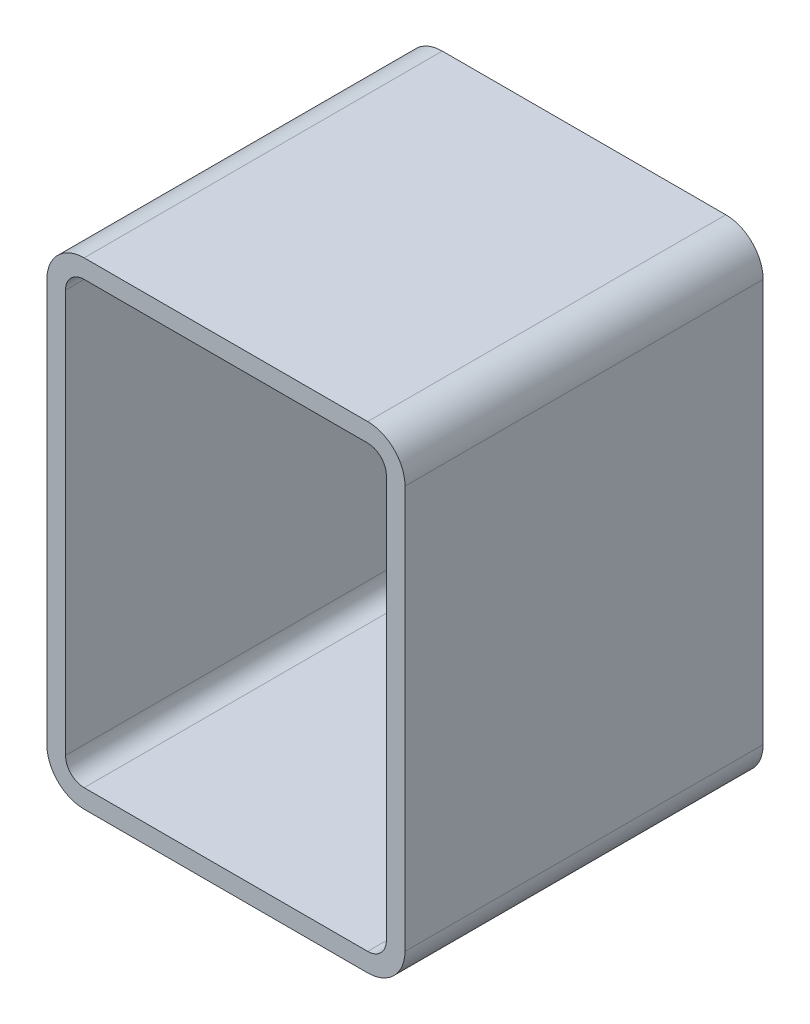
ISO-10303-21;
HEADER;
FILE_DESCRIPTION(('STEP AP214'),'2;1');
FILE_NAME('part.step','',(''),(''),'','','');
FILE_SCHEMA(('AUTOMOTIVE_DESIGN { 1 0 10303 214 1 1 1 1 }'));
ENDSEC;
DATA;
#1=APPLICATION_CONTEXT('core data for automotive mechanical design processes');
#2=APPLICATION_PROTOCOL_DEFINITION('international standard','automotive_design',2000,#1);
#3=PRODUCT_CONTEXT('',#1,'mechanical');
#4=PRODUCT('Part','Part','',(#3));
#5=PRODUCT_RELATED_PRODUCT_CATEGORY('part','',(#4));
#6=PRODUCT_DEFINITION_FORMATION('','',#4);
#7=PRODUCT_DEFINITION_CONTEXT('part definition',#1,'design');
#8=PRODUCT_DEFINITION('design','',#6,#7);
#9=PRODUCT_DEFINITION_SHAPE('','',#8);
#10=(LENGTH_UNIT() NAMED_UNIT(*) SI_UNIT(.MILLI.,.METRE.));
#11=(NAMED_UNIT(*) PLANE_ANGLE_UNIT() SI_UNIT($,.RADIAN.));
#12=(NAMED_UNIT(*) SI_UNIT($,.STERADIAN.) SOLID_ANGLE_UNIT());
#13=UNCERTAINTY_MEASURE_WITH_UNIT(LENGTH_MEASURE(1.E-05),#10,'distance_accuracy_value','');
#14=(GEOMETRIC_REPRESENTATION_CONTEXT(3) GLOBAL_UNCERTAINTY_ASSIGNED_CONTEXT((#13)) GLOBAL_UNIT_ASSIGNED_CONTEXT((#10,
#11,#12)) REPRESENTATION_CONTEXT('',''));
#15=CARTESIAN_POINT('',(0.,0.,0.));
#16=DIRECTION('',(0.,0.,1.));
#17=DIRECTION('',(1.,0.,0.));
#18=AXIS2_PLACEMENT_3D('',#15,#16,#17);
#19=CARTESIAN_POINT('',(32.8567030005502,376.432862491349,304.8));
#20=DIRECTION('',(0.,0.,1.));
#21=DIRECTION('',(1.,0.,0.));
#22=AXIS2_PLACEMENT_3D('',#19,#20,#21);
#23=PLANE('',#22);
#24=CARTESIAN_POINT('',(32.8567030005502,376.432862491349,304.8));
#25=DIRECTION('',(0.,0.,1.));
#26=DIRECTION('',(1.,0.,0.));
#27=AXIS2_PLACEMENT_3D('',#24,#25,#26);
#28=CIRCLE('',#27,31.75);
#29=CARTESIAN_POINT('',(32.8567030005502,408.182862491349,304.8));
#30=VERTEX_POINT('',#29);
#31=CARTESIAN_POINT('',(1.10670300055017,376.432862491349,304.8));
#32=VERTEX_POINT('',#31);
#33=EDGE_CURVE('E211',#30,#32,#28,.T.);
#34=ORIENTED_EDGE('',*,*,#33,.T.);
#35=DIRECTION('',(0.,-1.,0.));
#36=VECTOR('',#35,1.);
#37=CARTESIAN_POINT('',(1.10670300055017,33.5328624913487,304.8));
#38=LINE('',#37,#36);
#39=CARTESIAN_POINT('',(1.10670300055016,33.5328624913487,304.8));
#40=VERTEX_POINT('',#39);
#41=EDGE_CURVE('E214',#32,#40,#38,.T.);
#42=ORIENTED_EDGE('',*,*,#41,.T.);
#43=CARTESIAN_POINT('',(32.8567030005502,33.5328624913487,304.8));
#44=DIRECTION('',(0.,0.,1.));
#45=DIRECTION('',(1.,0.,0.));
#46=AXIS2_PLACEMENT_3D('',#43,#44,#45);
#47=CIRCLE('',#46,31.75);
#48=CARTESIAN_POINT('',(32.8567030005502,1.78286249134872,304.8));
#49=VERTEX_POINT('',#48);
#50=EDGE_CURVE('E217',#40,#49,#47,.T.);
#51=ORIENTED_EDGE('',*,*,#50,.T.);
#52=DIRECTION('',(1.,0.,0.));
#53=VECTOR('',#52,1.);
#54=CARTESIAN_POINT('',(274.15670300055,1.78286249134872,304.8));
#55=LINE('',#54,#53);
#56=CARTESIAN_POINT('',(274.15670300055,1.78286249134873,304.8));
#57=VERTEX_POINT('',#56);
#58=EDGE_CURVE('E219',#49,#57,#55,.T.);
#59=ORIENTED_EDGE('',*,*,#58,.T.);
#60=CARTESIAN_POINT('',(274.15670300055,33.5328624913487,304.8));
#61=DIRECTION('',(0.,0.,1.));
#62=DIRECTION('',(1.,0.,0.));
#63=AXIS2_PLACEMENT_3D('',#60,#61,#62);
#64=CIRCLE('',#63,31.75);
#65=CARTESIAN_POINT('',(305.90670300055,33.5328624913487,304.8));
#66=VERTEX_POINT('',#65);
#67=EDGE_CURVE('E221',#57,#66,#64,.T.);
#68=ORIENTED_EDGE('',*,*,#67,.T.);
#69=DIRECTION('',(0.,1.,0.));
#70=VECTOR('',#69,1.);
#71=CARTESIAN_POINT('',(305.90670300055,376.432862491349,304.8));
#72=LINE('',#71,#70);
#73=CARTESIAN_POINT('',(305.90670300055,376.432862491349,304.8));
#74=VERTEX_POINT('',#73);
#75=EDGE_CURVE('E223',#66,#74,#72,.T.);
#76=ORIENTED_EDGE('',*,*,#75,.T.);
#77=CARTESIAN_POINT('',(274.15670300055,376.432862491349,304.8));
#78=DIRECTION('',(0.,0.,1.));
#79=DIRECTION('',(1.,0.,0.));
#80=AXIS2_PLACEMENT_3D('',#77,#78,#79);
#81=CIRCLE('',#80,31.75);
#82=CARTESIAN_POINT('',(274.15670300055,408.182862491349,304.8));
#83=VERTEX_POINT('',#82);
#84=EDGE_CURVE('E225',#74,#83,#81,.T.);
#85=ORIENTED_EDGE('',*,*,#84,.T.);
#86=DIRECTION('',(-1.,0.,0.));
#87=VECTOR('',#86,1.);
#88=CARTESIAN_POINT('',(32.8567030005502,408.182862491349,304.8));
#89=LINE('',#88,#87);
#90=EDGE_CURVE('E227',#83,#30,#89,.T.);
#91=ORIENTED_EDGE('',*,*,#90,.T.);
#92=EDGE_LOOP('',(#34,#42,#51,#59,#68,#76,#85,#91));
#93=FACE_BOUND('',#92,.T.);
#94=DIRECTION('',(0.,-1.,0.));
#95=VECTOR('',#94,1.);
#96=CARTESIAN_POINT('',(16.9817030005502,33.5328624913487,304.8));
#97=LINE('',#96,#95);
#98=CARTESIAN_POINT('',(16.9817030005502,376.432862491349,304.8));
#99=VERTEX_POINT('',#98);
#100=CARTESIAN_POINT('',(16.9817030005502,33.5328624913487,304.8));
#101=VERTEX_POINT('',#100);
#102=EDGE_CURVE('E154',#99,#101,#97,.T.);
#103=ORIENTED_EDGE('',*,*,#102,.F.);
#104=CARTESIAN_POINT('',(32.8567030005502,376.432862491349,304.8));
#105=DIRECTION('',(0.,0.,1.));
#106=DIRECTION('',(1.,0.,0.));
#107=AXIS2_PLACEMENT_3D('',#104,#105,#106);
#108=CIRCLE('',#107,15.875);
#109=CARTESIAN_POINT('',(32.8567030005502,392.307862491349,304.8));
#110=VERTEX_POINT('',#109);
#111=EDGE_CURVE('E146',#110,#99,#108,.T.);
#112=ORIENTED_EDGE('',*,*,#111,.F.);
#113=DIRECTION('',(-1.,0.,0.));
#114=VECTOR('',#113,1.);
#115=CARTESIAN_POINT('',(32.8567030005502,392.307862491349,304.8));
#116=LINE('',#115,#114);
#117=CARTESIAN_POINT('',(274.15670300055,392.307862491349,304.8));
#118=VERTEX_POINT('',#117);
#119=EDGE_CURVE('E179',#118,#110,#116,.T.);
#120=ORIENTED_EDGE('',*,*,#119,.F.);
#121=CARTESIAN_POINT('',(274.15670300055,376.432862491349,304.8));
#122=DIRECTION('',(0.,0.,1.));
#123=DIRECTION('',(1.,0.,0.));
#124=AXIS2_PLACEMENT_3D('',#121,#122,#123);
#125=CIRCLE('',#124,15.875);
#126=CARTESIAN_POINT('',(290.03170300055,376.432862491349,304.8));
#127=VERTEX_POINT('',#126);
#128=EDGE_CURVE('E177',#127,#118,#125,.T.);
#129=ORIENTED_EDGE('',*,*,#128,.F.);
#130=DIRECTION('',(0.,1.,0.));
#131=VECTOR('',#130,1.);
#132=CARTESIAN_POINT('',(290.03170300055,376.432862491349,304.8));
#133=LINE('',#132,#131);
#134=CARTESIAN_POINT('',(290.03170300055,33.5328624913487,304.8));
#135=VERTEX_POINT('',#134);
#136=EDGE_CURVE('E175',#135,#127,#133,.T.);
#137=ORIENTED_EDGE('',*,*,#136,.F.);
#138=CARTESIAN_POINT('',(274.15670300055,33.5328624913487,304.8));
#139=DIRECTION('',(0.,0.,1.));
#140=DIRECTION('',(1.,0.,0.));
#141=AXIS2_PLACEMENT_3D('',#138,#139,#140);
#142=CIRCLE('',#141,15.875);
#143=CARTESIAN_POINT('',(274.15670300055,17.6578624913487,304.8));
#144=VERTEX_POINT('',#143);
#145=EDGE_CURVE('E173',#144,#135,#142,.T.);
#146=ORIENTED_EDGE('',*,*,#145,.F.);
#147=DIRECTION('',(1.,0.,0.));
#148=VECTOR('',#147,1.);
#149=CARTESIAN_POINT('',(274.15670300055,17.6578624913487,304.8));
#150=LINE('',#149,#148);
#151=CARTESIAN_POINT('',(32.8567030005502,17.6578624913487,304.8));
#152=VERTEX_POINT('',#151);
#153=EDGE_CURVE('E169',#152,#144,#150,.T.);
#154=ORIENTED_EDGE('',*,*,#153,.F.);
#155=CARTESIAN_POINT('',(32.8567030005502,33.5328624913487,304.8));
#156=DIRECTION('',(0.,0.,1.));
#157=DIRECTION('',(1.,0.,0.));
#158=AXIS2_PLACEMENT_3D('',#155,#156,#157);
#159=CIRCLE('',#158,15.875);
#160=EDGE_CURVE('E167',#101,#152,#159,.T.);
#161=ORIENTED_EDGE('',*,*,#160,.F.);
#162=EDGE_LOOP('',(#103,#112,#120,#129,#137,#146,#154,#161));
#163=FACE_BOUND('',#162,.T.);
#164=ADVANCED_FACE('F33',(#93,#163),#23,.T.);
#165=CARTESIAN_POINT('',(32.8567030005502,376.432862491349,0.));
#166=DIRECTION('',(0.,0.,1.));
#167=DIRECTION('',(1.,0.,0.));
#168=AXIS2_PLACEMENT_3D('',#165,#166,#167);
#169=PLANE('',#168);
#170=CARTESIAN_POINT('',(32.8567030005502,376.432862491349,0.));
#171=DIRECTION('',(0.,0.,1.));
#172=DIRECTION('',(1.,0.,0.));
#173=AXIS2_PLACEMENT_3D('',#170,#171,#172);
#174=CIRCLE('',#173,31.75);
#175=CARTESIAN_POINT('',(32.8567030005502,408.182862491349,0.));
#176=VERTEX_POINT('',#175);
#177=CARTESIAN_POINT('',(1.10670300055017,376.432862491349,0.));
#178=VERTEX_POINT('',#177);
#179=EDGE_CURVE('E162',#176,#178,#174,.T.);
#180=ORIENTED_EDGE('',*,*,#179,.F.);
#181=DIRECTION('',(-1.,0.,0.));
#182=VECTOR('',#181,1.);
#183=CARTESIAN_POINT('',(32.8567030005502,408.182862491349,0.));
#184=LINE('',#183,#182);
#185=CARTESIAN_POINT('',(274.15670300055,408.182862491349,0.));
#186=VERTEX_POINT('',#185);
#187=EDGE_CURVE('E215',#186,#176,#184,.T.);
#188=ORIENTED_EDGE('',*,*,#187,.F.);
#189=CARTESIAN_POINT('',(274.15670300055,376.432862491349,0.));
#190=DIRECTION('',(0.,0.,1.));
#191=DIRECTION('',(1.,0.,0.));
#192=AXIS2_PLACEMENT_3D('',#189,#190,#191);
#193=CIRCLE('',#192,31.75);
#194=CARTESIAN_POINT('',(305.90670300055,376.432862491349,0.));
#195=VERTEX_POINT('',#194);
#196=EDGE_CURVE('E242',#195,#186,#193,.T.);
#197=ORIENTED_EDGE('',*,*,#196,.F.);
#198=DIRECTION('',(0.,1.,0.));
#199=VECTOR('',#198,1.);
#200=CARTESIAN_POINT('',(305.90670300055,376.432862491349,0.));
#201=LINE('',#200,#199);
#202=CARTESIAN_POINT('',(305.90670300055,33.5328624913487,0.));
#203=VERTEX_POINT('',#202);
#204=EDGE_CURVE('E240',#203,#195,#201,.T.);
#205=ORIENTED_EDGE('',*,*,#204,.F.);
#206=CARTESIAN_POINT('',(274.15670300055,33.5328624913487,0.));
#207=DIRECTION('',(0.,0.,1.));
#208=DIRECTION('',(1.,0.,0.));
#209=AXIS2_PLACEMENT_3D('',#206,#207,#208);
#210=CIRCLE('',#209,31.75);
#211=CARTESIAN_POINT('',(274.15670300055,1.78286249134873,0.));
#212=VERTEX_POINT('',#211);
#213=EDGE_CURVE('E238',#212,#203,#210,.T.);
#214=ORIENTED_EDGE('',*,*,#213,.F.);
#215=DIRECTION('',(1.,0.,0.));
#216=VECTOR('',#215,1.);
#217=CARTESIAN_POINT('',(274.15670300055,1.78286249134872,0.));
#218=LINE('',#217,#216);
#219=CARTESIAN_POINT('',(32.8567030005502,1.78286249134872,0.));
#220=VERTEX_POINT('',#219);
#221=EDGE_CURVE('E236',#220,#212,#218,.T.);
#222=ORIENTED_EDGE('',*,*,#221,.F.);
#223=CARTESIAN_POINT('',(32.8567030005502,33.5328624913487,0.));
#224=DIRECTION('',(0.,0.,1.));
#225=DIRECTION('',(1.,0.,0.));
#226=AXIS2_PLACEMENT_3D('',#223,#224,#225);
#227=CIRCLE('',#226,31.75);
#228=CARTESIAN_POINT('',(1.10670300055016,33.5328624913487,0.));
#229=VERTEX_POINT('',#228);
#230=EDGE_CURVE('E234',#229,#220,#227,.T.);
#231=ORIENTED_EDGE('',*,*,#230,.F.);
#232=DIRECTION('',(0.,-1.,0.));
#233=VECTOR('',#232,1.);
#234=CARTESIAN_POINT('',(1.10670300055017,33.5328624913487,0.));
#235=LINE('',#234,#233);
#236=EDGE_CURVE('E232',#178,#229,#235,.T.);
#237=ORIENTED_EDGE('',*,*,#236,.F.);
#238=EDGE_LOOP('',(#180,#188,#197,#205,#214,#222,#231,#237));
#239=FACE_BOUND('',#238,.T.);
#240=CARTESIAN_POINT('',(32.8567030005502,376.432862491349,0.));
#241=DIRECTION('',(0.,0.,1.));
#242=DIRECTION('',(1.,0.,0.));
#243=AXIS2_PLACEMENT_3D('',#240,#241,#242);
#244=CIRCLE('',#243,15.875);
#245=CARTESIAN_POINT('',(32.8567030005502,392.307862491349,0.));
#246=VERTEX_POINT('',#245);
#247=CARTESIAN_POINT('',(16.9817030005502,376.432862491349,0.));
#248=VERTEX_POINT('',#247);
#249=EDGE_CURVE('E56',#246,#248,#244,.T.);
#250=ORIENTED_EDGE('',*,*,#249,.T.);
#251=DIRECTION('',(0.,-1.,0.));
#252=VECTOR('',#251,1.);
#253=CARTESIAN_POINT('',(16.9817030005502,33.5328624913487,0.));
#254=LINE('',#253,#252);
#255=CARTESIAN_POINT('',(16.9817030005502,33.5328624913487,0.));
#256=VERTEX_POINT('',#255);
#257=EDGE_CURVE('E161',#248,#256,#254,.T.);
#258=ORIENTED_EDGE('',*,*,#257,.T.);
#259=CARTESIAN_POINT('',(32.8567030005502,33.5328624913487,0.));
#260=DIRECTION('',(0.,0.,1.));
#261=DIRECTION('',(1.,0.,0.));
#262=AXIS2_PLACEMENT_3D('',#259,#260,#261);
#263=CIRCLE('',#262,15.875);
#264=CARTESIAN_POINT('',(32.8567030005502,17.6578624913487,0.));
#265=VERTEX_POINT('',#264);
#266=EDGE_CURVE('E183',#256,#265,#263,.T.);
#267=ORIENTED_EDGE('',*,*,#266,.T.);
#268=DIRECTION('',(1.,0.,0.));
#269=VECTOR('',#268,1.);
#270=CARTESIAN_POINT('',(274.15670300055,17.6578624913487,0.));
#271=LINE('',#270,#269);
#272=CARTESIAN_POINT('',(274.15670300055,17.6578624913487,0.));
#273=VERTEX_POINT('',#272);
#274=EDGE_CURVE('E186',#265,#273,#271,.T.);
#275=ORIENTED_EDGE('',*,*,#274,.T.);
#276=CARTESIAN_POINT('',(274.15670300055,33.5328624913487,0.));
#277=DIRECTION('',(0.,0.,1.));
#278=DIRECTION('',(1.,0.,0.));
#279=AXIS2_PLACEMENT_3D('',#276,#277,#278);
#280=CIRCLE('',#279,15.875);
#281=CARTESIAN_POINT('',(290.03170300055,33.5328624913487,0.));
#282=VERTEX_POINT('',#281);
#283=EDGE_CURVE('E189',#273,#282,#280,.T.);
#284=ORIENTED_EDGE('',*,*,#283,.T.);
#285=DIRECTION('',(0.,1.,0.));
#286=VECTOR('',#285,1.);
#287=CARTESIAN_POINT('',(290.03170300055,376.432862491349,0.));
#288=LINE('',#287,#286);
#289=CARTESIAN_POINT('',(290.03170300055,376.432862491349,0.));
#290=VERTEX_POINT('',#289);
#291=EDGE_CURVE('E192',#282,#290,#288,.T.);
#292=ORIENTED_EDGE('',*,*,#291,.T.);
#293=CARTESIAN_POINT('',(274.15670300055,376.432862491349,0.));
#294=DIRECTION('',(0.,0.,1.));
#295=DIRECTION('',(1.,0.,0.));
#296=AXIS2_PLACEMENT_3D('',#293,#294,#295);
#297=CIRCLE('',#296,15.875);
#298=CARTESIAN_POINT('',(274.15670300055,392.307862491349,0.));
#299=VERTEX_POINT('',#298);
#300=EDGE_CURVE('E195',#290,#299,#297,.T.);
#301=ORIENTED_EDGE('',*,*,#300,.T.);
#302=DIRECTION('',(-1.,0.,0.));
#303=VECTOR('',#302,1.);
#304=CARTESIAN_POINT('',(32.8567030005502,392.307862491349,0.));
#305=LINE('',#304,#303);
#306=EDGE_CURVE('E155',#299,#246,#305,.T.);
#307=ORIENTED_EDGE('',*,*,#306,.T.);
#308=EDGE_LOOP('',(#250,#258,#267,#275,#284,#292,#301,#307));
#309=FACE_BOUND('',#308,.T.);
#310=ADVANCED_FACE('F272',(#239,#309),#169,.F.);
#311=CARTESIAN_POINT('',(32.8567030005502,376.432862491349,304.8));
#312=DIRECTION('',(0.,0.,-1.));
#313=DIRECTION('',(-1.,0.,0.));
#314=AXIS2_PLACEMENT_3D('',#311,#312,#313);
#315=CYLINDRICAL_SURFACE('',#314,31.75);
#316=ORIENTED_EDGE('',*,*,#179,.T.);
#317=DIRECTION('',(0.,0.,-1.));
#318=VECTOR('',#317,1.);
#319=CARTESIAN_POINT('',(1.10670300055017,376.432862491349,304.8));
#320=LINE('',#319,#318);
#321=EDGE_CURVE('E11',#32,#178,#320,.T.);
#322=ORIENTED_EDGE('',*,*,#321,.F.);
#323=ORIENTED_EDGE('',*,*,#33,.F.);
#324=DIRECTION('',(0.,0.,-1.));
#325=VECTOR('',#324,1.);
#326=CARTESIAN_POINT('',(32.8567030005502,408.182862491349,304.8));
#327=LINE('',#326,#325);
#328=EDGE_CURVE('E229',#30,#176,#327,.T.);
#329=ORIENTED_EDGE('',*,*,#328,.T.);
#330=EDGE_LOOP('',(#316,#322,#323,#329));
#331=FACE_BOUND('',#330,.T.);
#332=ADVANCED_FACE('F35',(#331),#315,.T.);
#333=CARTESIAN_POINT('',(1.10670300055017,33.5328624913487,304.8));
#334=DIRECTION('',(1.,0.,0.));
#335=DIRECTION('',(0.,0.,-1.));
#336=AXIS2_PLACEMENT_3D('',#333,#334,#335);
#337=PLANE('',#336);
#338=ORIENTED_EDGE('',*,*,#236,.T.);
#339=DIRECTION('',(0.,0.,-1.));
#340=VECTOR('',#339,1.);
#341=CARTESIAN_POINT('',(1.10670300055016,33.5328624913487,304.8));
#342=LINE('',#341,#340);
#343=EDGE_CURVE('E41',#40,#229,#342,.T.);
#344=ORIENTED_EDGE('',*,*,#343,.F.);
#345=ORIENTED_EDGE('',*,*,#41,.F.);
#346=ORIENTED_EDGE('',*,*,#321,.T.);
#347=EDGE_LOOP('',(#338,#344,#345,#346));
#348=FACE_BOUND('',#347,.T.);
#349=ADVANCED_FACE('F289',(#348),#337,.F.);
#350=CARTESIAN_POINT('',(32.8567030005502,33.5328624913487,304.8));
#351=DIRECTION('',(0.,0.,-1.));
#352=DIRECTION('',(-1.,0.,0.));
#353=AXIS2_PLACEMENT_3D('',#350,#351,#352);
#354=CYLINDRICAL_SURFACE('',#353,31.75);
#355=ORIENTED_EDGE('',*,*,#230,.T.);
#356=DIRECTION('',(0.,0.,-1.));
#357=VECTOR('',#356,1.);
#358=CARTESIAN_POINT('',(32.8567030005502,1.78286249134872,304.8));
#359=LINE('',#358,#357);
#360=EDGE_CURVE('E259',#49,#220,#359,.T.);
#361=ORIENTED_EDGE('',*,*,#360,.F.);
#362=ORIENTED_EDGE('',*,*,#50,.F.);
#363=ORIENTED_EDGE('',*,*,#343,.T.);
#364=EDGE_LOOP('',(#355,#361,#362,#363));
#365=FACE_BOUND('',#364,.T.);
#366=ADVANCED_FACE('F266',(#365),#354,.T.);
#367=CARTESIAN_POINT('',(274.15670300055,1.78286249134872,304.8));
#368=DIRECTION('',(0.,1.,0.));
#369=DIRECTION('',(0.,0.,1.));
#370=AXIS2_PLACEMENT_3D('',#367,#368,#369);
#371=PLANE('',#370);
#372=ORIENTED_EDGE('',*,*,#221,.T.);
#373=DIRECTION('',(0.,0.,-1.));
#374=VECTOR('',#373,1.);
#375=CARTESIAN_POINT('',(274.15670300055,1.78286249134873,304.8));
#376=LINE('',#375,#374);
#377=EDGE_CURVE('E256',#57,#212,#376,.T.);
#378=ORIENTED_EDGE('',*,*,#377,.F.);
#379=ORIENTED_EDGE('',*,*,#58,.F.);
#380=ORIENTED_EDGE('',*,*,#360,.T.);
#381=EDGE_LOOP('',(#372,#378,#379,#380));
#382=FACE_BOUND('',#381,.T.);
#383=ADVANCED_FACE('F278',(#382),#371,.F.);
#384=CARTESIAN_POINT('',(274.15670300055,33.5328624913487,304.8));
#385=DIRECTION('',(0.,0.,-1.));
#386=DIRECTION('',(-1.,0.,0.));
#387=AXIS2_PLACEMENT_3D('',#384,#385,#386);
#388=CYLINDRICAL_SURFACE('',#387,31.75);
#389=ORIENTED_EDGE('',*,*,#213,.T.);
#390=DIRECTION('',(0.,0.,-1.));
#391=VECTOR('',#390,1.);
#392=CARTESIAN_POINT('',(305.90670300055,33.5328624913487,304.8));
#393=LINE('',#392,#391);
#394=EDGE_CURVE('E253',#66,#203,#393,.T.);
#395=ORIENTED_EDGE('',*,*,#394,.F.);
#396=ORIENTED_EDGE('',*,*,#67,.F.);
#397=ORIENTED_EDGE('',*,*,#377,.T.);
#398=EDGE_LOOP('',(#389,#395,#396,#397));
#399=FACE_BOUND('',#398,.T.);
#400=ADVANCED_FACE('F282',(#399),#388,.T.);
#401=CARTESIAN_POINT('',(305.90670300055,376.432862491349,304.8));
#402=DIRECTION('',(-1.,0.,0.));
#403=DIRECTION('',(0.,0.,1.));
#404=AXIS2_PLACEMENT_3D('',#401,#402,#403);
#405=PLANE('',#404);
#406=ORIENTED_EDGE('',*,*,#204,.T.);
#407=DIRECTION('',(0.,0.,-1.));
#408=VECTOR('',#407,1.);
#409=CARTESIAN_POINT('',(305.90670300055,376.432862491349,304.8));
#410=LINE('',#409,#408);
#411=EDGE_CURVE('E250',#74,#195,#410,.T.);
#412=ORIENTED_EDGE('',*,*,#411,.F.);
#413=ORIENTED_EDGE('',*,*,#75,.F.);
#414=ORIENTED_EDGE('',*,*,#394,.T.);
#415=EDGE_LOOP('',(#406,#412,#413,#414));
#416=FACE_BOUND('',#415,.T.);
#417=ADVANCED_FACE('F302',(#416),#405,.F.);
#418=CARTESIAN_POINT('',(274.15670300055,376.432862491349,304.8));
#419=DIRECTION('',(0.,0.,-1.));
#420=DIRECTION('',(-1.,0.,0.));
#421=AXIS2_PLACEMENT_3D('',#418,#419,#420);
#422=CYLINDRICAL_SURFACE('',#421,31.75);
#423=ORIENTED_EDGE('',*,*,#196,.T.);
#424=DIRECTION('',(0.,0.,-1.));
#425=VECTOR('',#424,1.);
#426=CARTESIAN_POINT('',(274.15670300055,408.182862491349,304.8));
#427=LINE('',#426,#425);
#428=EDGE_CURVE('E247',#83,#186,#427,.T.);
#429=ORIENTED_EDGE('',*,*,#428,.F.);
#430=ORIENTED_EDGE('',*,*,#84,.F.);
#431=ORIENTED_EDGE('',*,*,#411,.T.);
#432=EDGE_LOOP('',(#423,#429,#430,#431));
#433=FACE_BOUND('',#432,.T.);
#434=ADVANCED_FACE('F300',(#433),#422,.T.);
#435=CARTESIAN_POINT('',(32.8567030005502,408.182862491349,304.8));
#436=DIRECTION('',(0.,-1.,0.));
#437=DIRECTION('',(0.,0.,-1.));
#438=AXIS2_PLACEMENT_3D('',#435,#436,#437);
#439=PLANE('',#438);
#440=ORIENTED_EDGE('',*,*,#187,.T.);
#441=ORIENTED_EDGE('',*,*,#328,.F.);
#442=ORIENTED_EDGE('',*,*,#90,.F.);
#443=ORIENTED_EDGE('',*,*,#428,.T.);
#444=EDGE_LOOP('',(#440,#441,#442,#443));
#445=FACE_BOUND('',#444,.T.);
#446=ADVANCED_FACE('F295',(#445),#439,.F.);
#447=CARTESIAN_POINT('',(32.8567030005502,376.432862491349,304.8));
#448=DIRECTION('',(0.,0.,-1.));
#449=DIRECTION('',(-1.,0.,0.));
#450=AXIS2_PLACEMENT_3D('',#447,#448,#449);
#451=CYLINDRICAL_SURFACE('',#450,15.875);
#452=ORIENTED_EDGE('',*,*,#249,.F.);
#453=DIRECTION('',(0.,0.,-1.));
#454=VECTOR('',#453,1.);
#455=CARTESIAN_POINT('',(32.8567030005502,392.307862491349,304.8));
#456=LINE('',#455,#454);
#457=EDGE_CURVE('E150',#110,#246,#456,.T.);
#458=ORIENTED_EDGE('',*,*,#457,.F.);
#459=ORIENTED_EDGE('',*,*,#111,.T.);
#460=DIRECTION('',(0.,0.,-1.));
#461=VECTOR('',#460,1.);
#462=CARTESIAN_POINT('',(16.9817030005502,376.432862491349,304.8));
#463=LINE('',#462,#461);
#464=EDGE_CURVE('E149',#99,#248,#463,.T.);
#465=ORIENTED_EDGE('',*,*,#464,.T.);
#466=EDGE_LOOP('',(#452,#458,#459,#465));
#467=FACE_BOUND('',#466,.T.);
#468=ADVANCED_FACE('F148',(#467),#451,.F.);
#469=CARTESIAN_POINT('',(16.9817030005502,33.5328624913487,304.8));
#470=DIRECTION('',(1.,0.,0.));
#471=DIRECTION('',(0.,0.,-1.));
#472=AXIS2_PLACEMENT_3D('',#469,#470,#471);
#473=PLANE('',#472);
#474=ORIENTED_EDGE('',*,*,#257,.F.);
#475=ORIENTED_EDGE('',*,*,#464,.F.);
#476=ORIENTED_EDGE('',*,*,#102,.T.);
#477=DIRECTION('',(0.,0.,-1.));
#478=VECTOR('',#477,1.);
#479=CARTESIAN_POINT('',(16.9817030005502,33.5328624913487,304.8));
#480=LINE('',#479,#478);
#481=EDGE_CURVE('E163',#101,#256,#480,.T.);
#482=ORIENTED_EDGE('',*,*,#481,.T.);
#483=EDGE_LOOP('',(#474,#475,#476,#482));
#484=FACE_BOUND('',#483,.T.);
#485=ADVANCED_FACE('F158',(#484),#473,.T.);
#486=CARTESIAN_POINT('',(32.8567030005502,33.5328624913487,304.8));
#487=DIRECTION('',(0.,0.,-1.));
#488=DIRECTION('',(-1.,0.,0.));
#489=AXIS2_PLACEMENT_3D('',#486,#487,#488);
#490=CYLINDRICAL_SURFACE('',#489,15.875);
#491=ORIENTED_EDGE('',*,*,#266,.F.);
#492=ORIENTED_EDGE('',*,*,#481,.F.);
#493=ORIENTED_EDGE('',*,*,#160,.T.);
#494=DIRECTION('',(0.,0.,-1.));
#495=VECTOR('',#494,1.);
#496=CARTESIAN_POINT('',(32.8567030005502,17.6578624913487,304.8));
#497=LINE('',#496,#495);
#498=EDGE_CURVE('E208',#152,#265,#497,.T.);
#499=ORIENTED_EDGE('',*,*,#498,.T.);
#500=EDGE_LOOP('',(#491,#492,#493,#499));
#501=FACE_BOUND('',#500,.T.);
#502=ADVANCED_FACE('F327',(#501),#490,.F.);
#503=CARTESIAN_POINT('',(274.15670300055,17.6578624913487,304.8));
#504=DIRECTION('',(0.,1.,0.));
#505=DIRECTION('',(0.,0.,1.));
#506=AXIS2_PLACEMENT_3D('',#503,#504,#505);
#507=PLANE('',#506);
#508=ORIENTED_EDGE('',*,*,#274,.F.);
#509=ORIENTED_EDGE('',*,*,#498,.F.);
#510=ORIENTED_EDGE('',*,*,#153,.T.);
#511=DIRECTION('',(0.,0.,-1.));
#512=VECTOR('',#511,1.);
#513=CARTESIAN_POINT('',(274.15670300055,17.6578624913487,304.8));
#514=LINE('',#513,#512);
#515=EDGE_CURVE('E206',#144,#273,#514,.T.);
#516=ORIENTED_EDGE('',*,*,#515,.T.);
#517=EDGE_LOOP('',(#508,#509,#510,#516));
#518=FACE_BOUND('',#517,.T.);
#519=ADVANCED_FACE('F331',(#518),#507,.T.);
#520=CARTESIAN_POINT('',(274.15670300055,33.5328624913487,304.8));
#521=DIRECTION('',(0.,0.,-1.));
#522=DIRECTION('',(-1.,0.,0.));
#523=AXIS2_PLACEMENT_3D('',#520,#521,#522);
#524=CYLINDRICAL_SURFACE('',#523,15.875);
#525=ORIENTED_EDGE('',*,*,#283,.F.);
#526=ORIENTED_EDGE('',*,*,#515,.F.);
#527=ORIENTED_EDGE('',*,*,#145,.T.);
#528=DIRECTION('',(0.,0.,-1.));
#529=VECTOR('',#528,1.);
#530=CARTESIAN_POINT('',(290.03170300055,33.5328624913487,304.8));
#531=LINE('',#530,#529);
#532=EDGE_CURVE('E204',#135,#282,#531,.T.);
#533=ORIENTED_EDGE('',*,*,#532,.T.);
#534=EDGE_LOOP('',(#525,#526,#527,#533));
#535=FACE_BOUND('',#534,.T.);
#536=ADVANCED_FACE('F337',(#535),#524,.F.);
#537=CARTESIAN_POINT('',(290.03170300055,376.432862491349,304.8));
#538=DIRECTION('',(-1.,0.,0.));
#539=DIRECTION('',(0.,0.,1.));
#540=AXIS2_PLACEMENT_3D('',#537,#538,#539);
#541=PLANE('',#540);
#542=ORIENTED_EDGE('',*,*,#291,.F.);
#543=ORIENTED_EDGE('',*,*,#532,.F.);
#544=ORIENTED_EDGE('',*,*,#136,.T.);
#545=DIRECTION('',(0.,0.,-1.));
#546=VECTOR('',#545,1.);
#547=CARTESIAN_POINT('',(290.03170300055,376.432862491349,304.8));
#548=LINE('',#547,#546);
#549=EDGE_CURVE('E202',#127,#290,#548,.T.);
#550=ORIENTED_EDGE('',*,*,#549,.T.);
#551=EDGE_LOOP('',(#542,#543,#544,#550));
#552=FACE_BOUND('',#551,.T.);
#553=ADVANCED_FACE('F341',(#552),#541,.T.);
#554=CARTESIAN_POINT('',(274.15670300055,376.432862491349,304.8));
#555=DIRECTION('',(0.,0.,-1.));
#556=DIRECTION('',(-1.,0.,0.));
#557=AXIS2_PLACEMENT_3D('',#554,#555,#556);
#558=CYLINDRICAL_SURFACE('',#557,15.875);
#559=ORIENTED_EDGE('',*,*,#300,.F.);
#560=ORIENTED_EDGE('',*,*,#549,.F.);
#561=ORIENTED_EDGE('',*,*,#128,.T.);
#562=DIRECTION('',(0.,0.,-1.));
#563=VECTOR('',#562,1.);
#564=CARTESIAN_POINT('',(274.15670300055,392.307862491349,304.8));
#565=LINE('',#564,#563);
#566=EDGE_CURVE('E48',#118,#299,#565,.T.);
#567=ORIENTED_EDGE('',*,*,#566,.T.);
#568=EDGE_LOOP('',(#559,#560,#561,#567));
#569=FACE_BOUND('',#568,.T.);
#570=ADVANCED_FACE('F345',(#569),#558,.F.);
#571=CARTESIAN_POINT('',(32.8567030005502,392.307862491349,304.8));
#572=DIRECTION('',(0.,-1.,0.));
#573=DIRECTION('',(0.,0.,-1.));
#574=AXIS2_PLACEMENT_3D('',#571,#572,#573);
#575=PLANE('',#574);
#576=ORIENTED_EDGE('',*,*,#306,.F.);
#577=ORIENTED_EDGE('',*,*,#566,.F.);
#578=ORIENTED_EDGE('',*,*,#119,.T.);
#579=ORIENTED_EDGE('',*,*,#457,.T.);
#580=EDGE_LOOP('',(#576,#577,#578,#579));
#581=FACE_BOUND('',#580,.T.);
#582=ADVANCED_FACE('F349',(#581),#575,.T.);
#583=CLOSED_SHELL('',(#164,#310,#332,#349,#366,#383,#400,#417,#434,#446,#468,#485,#502,#519,
#536,#553,#570,#582));
#584=MANIFOLD_SOLID_BREP('B2',#583);
#585=ADVANCED_BREP_SHAPE_REPRESENTATION('',(#18,#584),#14);
#586=SHAPE_DEFINITION_REPRESENTATION(#9,#585);
ENDSEC;
END-ISO-10303-21;
